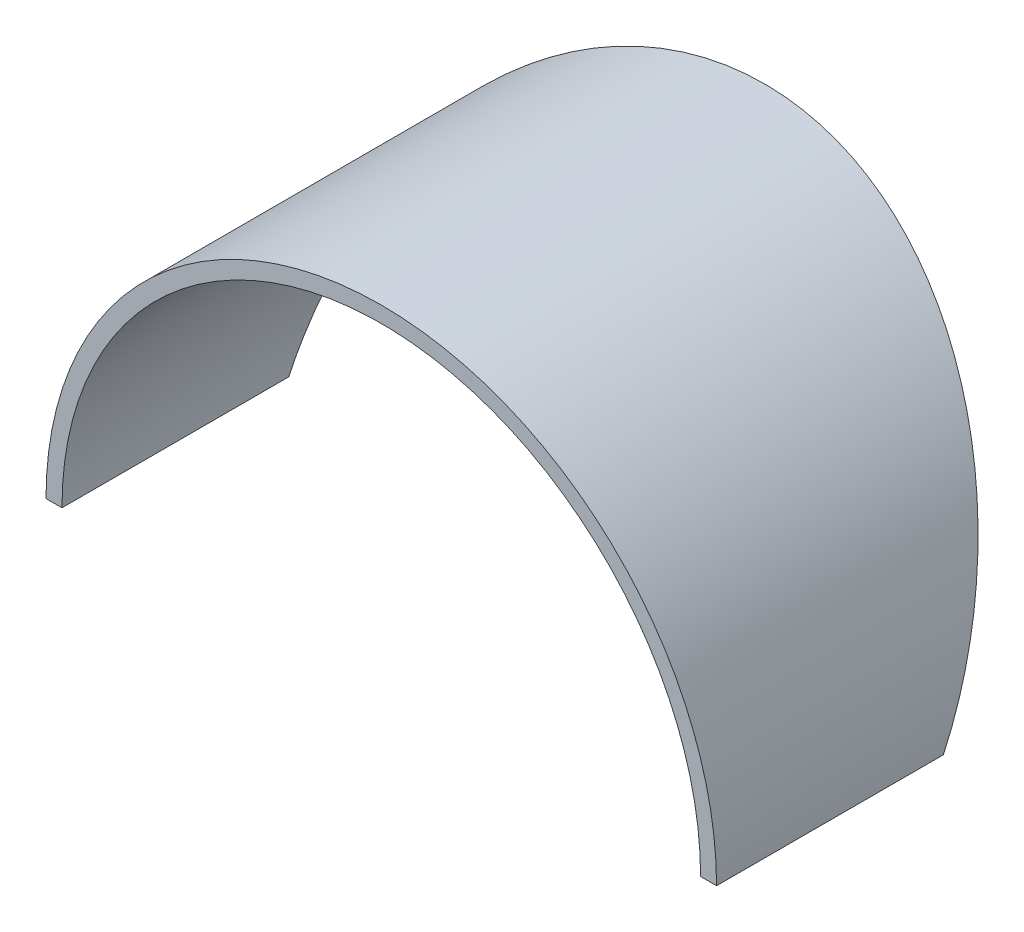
ISO-10303-21;
HEADER;
FILE_DESCRIPTION(('STEP AP214'),'2;1');
FILE_NAME('part.step','',(''),(''),'','','');
FILE_SCHEMA(('AUTOMOTIVE_DESIGN { 1 0 10303 214 1 1 1 1 }'));
ENDSEC;
DATA;
#1=APPLICATION_CONTEXT('core data for automotive mechanical design processes');
#2=APPLICATION_PROTOCOL_DEFINITION('international standard','automotive_design',2000,#1);
#3=PRODUCT_CONTEXT('',#1,'mechanical');
#4=PRODUCT('Part','Part','',(#3));
#5=PRODUCT_RELATED_PRODUCT_CATEGORY('part','',(#4));
#6=PRODUCT_DEFINITION_FORMATION('','',#4);
#7=PRODUCT_DEFINITION_CONTEXT('part definition',#1,'design');
#8=PRODUCT_DEFINITION('design','',#6,#7);
#9=PRODUCT_DEFINITION_SHAPE('','',#8);
#10=(LENGTH_UNIT() NAMED_UNIT(*) SI_UNIT(.MILLI.,.METRE.));
#11=(NAMED_UNIT(*) PLANE_ANGLE_UNIT() SI_UNIT($,.RADIAN.));
#12=(NAMED_UNIT(*) SI_UNIT($,.STERADIAN.) SOLID_ANGLE_UNIT());
#13=UNCERTAINTY_MEASURE_WITH_UNIT(LENGTH_MEASURE(1.E-05),#10,'distance_accuracy_value','');
#14=(GEOMETRIC_REPRESENTATION_CONTEXT(3) GLOBAL_UNCERTAINTY_ASSIGNED_CONTEXT((#13)) GLOBAL_UNIT_ASSIGNED_CONTEXT((#10,
#11,#12)) REPRESENTATION_CONTEXT('',''));
#15=CARTESIAN_POINT('',(0.,0.,0.));
#16=DIRECTION('',(0.,0.,1.));
#17=DIRECTION('',(1.,0.,0.));
#18=AXIS2_PLACEMENT_3D('',#15,#16,#17);
#19=CARTESIAN_POINT('',(-118.872,109.22,76.2));
#20=DIRECTION('',(0.,0.,-1.));
#21=DIRECTION('',(-1.,0.,0.));
#22=AXIS2_PLACEMENT_3D('',#19,#20,#21);
#23=CYLINDRICAL_SURFACE('',#22,63.5);
#24=DIRECTION('',(0.,0.,-1.));
#25=VECTOR('',#24,1.);
#26=CARTESIAN_POINT('',(-182.372,109.22,76.2));
#27=LINE('',#26,#25);
#28=CARTESIAN_POINT('',(-182.372,109.22,76.2));
#29=VERTEX_POINT('',#28);
#30=CARTESIAN_POINT('',(-182.372,109.22,31.091063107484));
#31=VERTEX_POINT('',#30);
#32=EDGE_CURVE('E92',#29,#31,#27,.T.);
#33=ORIENTED_EDGE('',*,*,#32,.T.);
#34=CARTESIAN_POINT('',(-118.872,109.22,31.091063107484));
#35=DIRECTION('',(0.,0.422618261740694,0.906307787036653));
#36=DIRECTION('',(0.,0.906307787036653,-0.422618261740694));
#37=AXIS2_PLACEMENT_3D('',#34,#35,#36);
#38=ELLIPSE('',#37,70.064497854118,63.5);
#39=CARTESIAN_POINT('',(-55.372,109.22,31.091063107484));
#40=VERTEX_POINT('',#39);
#41=EDGE_CURVE('E49',#31,#40,#38,.F.);
#42=ORIENTED_EDGE('',*,*,#41,.T.);
#43=DIRECTION('',(0.,0.,-1.));
#44=VECTOR('',#43,1.);
#45=CARTESIAN_POINT('',(-55.372,109.22,76.2));
#46=LINE('',#45,#44);
#47=CARTESIAN_POINT('',(-55.372,109.22,76.2));
#48=VERTEX_POINT('',#47);
#49=EDGE_CURVE('E11',#48,#40,#46,.T.);
#50=ORIENTED_EDGE('',*,*,#49,.F.);
#51=CARTESIAN_POINT('',(-118.872,109.22,76.2));
#52=DIRECTION('',(0.,0.,-1.));
#53=DIRECTION('',(1.,0.,0.));
#54=AXIS2_PLACEMENT_3D('',#51,#52,#53);
#55=CIRCLE('',#54,63.5);
#56=EDGE_CURVE('E101',#29,#48,#55,.T.);
#57=ORIENTED_EDGE('',*,*,#56,.F.);
#58=EDGE_LOOP('',(#33,#42,#50,#57));
#59=FACE_BOUND('',#58,.T.);
#60=ADVANCED_FACE('F35',(#59),#23,.F.);
#61=CARTESIAN_POINT('',(-55.372,109.22,76.2));
#62=DIRECTION('',(0.,1.,0.));
#63=DIRECTION('',(0.,0.,1.));
#64=AXIS2_PLACEMENT_3D('',#61,#62,#63);
#65=PLANE('',#64);
#66=ORIENTED_EDGE('',*,*,#49,.T.);
#67=DIRECTION('',(1.,0.,0.));
#68=VECTOR('',#67,1.);
#69=CARTESIAN_POINT('',(-185.547,109.22,31.091063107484));
#70=LINE('',#69,#68);
#71=CARTESIAN_POINT('',(-52.197,109.22,31.091063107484));
#72=VERTEX_POINT('',#71);
#73=EDGE_CURVE('E89',#40,#72,#70,.T.);
#74=ORIENTED_EDGE('',*,*,#73,.T.);
#75=DIRECTION('',(0.,0.,-1.));
#76=VECTOR('',#75,1.);
#77=CARTESIAN_POINT('',(-52.197,109.22,76.2));
#78=LINE('',#77,#76);
#79=CARTESIAN_POINT('',(-52.197,109.22,76.2));
#80=VERTEX_POINT('',#79);
#81=EDGE_CURVE('E42',#80,#72,#78,.T.);
#82=ORIENTED_EDGE('',*,*,#81,.F.);
#83=DIRECTION('',(1.,0.,0.));
#84=VECTOR('',#83,1.);
#85=CARTESIAN_POINT('',(-55.372,109.22,76.2));
#86=LINE('',#85,#84);
#87=EDGE_CURVE('E99',#48,#80,#86,.T.);
#88=ORIENTED_EDGE('',*,*,#87,.F.);
#89=EDGE_LOOP('',(#66,#74,#82,#88));
#90=FACE_BOUND('',#89,.T.);
#91=ADVANCED_FACE('F107',(#90),#65,.F.);
#92=CARTESIAN_POINT('',(-118.872,109.22,76.2));
#93=DIRECTION('',(0.,0.,-1.));
#94=DIRECTION('',(-1.,0.,0.));
#95=AXIS2_PLACEMENT_3D('',#92,#93,#94);
#96=CYLINDRICAL_SURFACE('',#95,66.675);
#97=CARTESIAN_POINT('',(-118.872,109.22,31.091063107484));
#98=DIRECTION('',(0.,0.422618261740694,0.906307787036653));
#99=DIRECTION('',(0.,0.906307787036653,-0.422618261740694));
#100=AXIS2_PLACEMENT_3D('',#97,#98,#99);
#101=ELLIPSE('',#100,73.5677227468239,66.675);
#102=CARTESIAN_POINT('',(-185.547,109.22,31.091063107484));
#103=VERTEX_POINT('',#102);
#104=EDGE_CURVE('E77',#72,#103,#101,.T.);
#105=ORIENTED_EDGE('',*,*,#104,.T.);
#106=DIRECTION('',(0.,0.,-1.));
#107=VECTOR('',#106,1.);
#108=CARTESIAN_POINT('',(-185.547,109.22,76.2));
#109=LINE('',#108,#107);
#110=CARTESIAN_POINT('',(-185.547,109.22,76.2));
#111=VERTEX_POINT('',#110);
#112=EDGE_CURVE('E81',#111,#103,#109,.T.);
#113=ORIENTED_EDGE('',*,*,#112,.F.);
#114=CARTESIAN_POINT('',(-118.872,109.22,76.2));
#115=DIRECTION('',(0.,0.,1.));
#116=DIRECTION('',(1.,0.,0.));
#117=AXIS2_PLACEMENT_3D('',#114,#115,#116);
#118=CIRCLE('',#117,66.675);
#119=EDGE_CURVE('E97',#80,#111,#118,.T.);
#120=ORIENTED_EDGE('',*,*,#119,.F.);
#121=ORIENTED_EDGE('',*,*,#81,.T.);
#122=EDGE_LOOP('',(#105,#113,#120,#121));
#123=FACE_BOUND('',#122,.T.);
#124=ADVANCED_FACE('F78',(#123),#96,.T.);
#125=CARTESIAN_POINT('',(-182.372,109.22,76.2));
#126=DIRECTION('',(0.,1.,0.));
#127=DIRECTION('',(-1.,0.,0.));
#128=AXIS2_PLACEMENT_3D('',#125,#126,#127);
#129=PLANE('',#128);
#130=ORIENTED_EDGE('',*,*,#112,.T.);
#131=EDGE_CURVE('E84',#103,#31,#70,.T.);
#132=ORIENTED_EDGE('',*,*,#131,.T.);
#133=ORIENTED_EDGE('',*,*,#32,.F.);
#134=DIRECTION('',(1.,0.,0.));
#135=VECTOR('',#134,1.);
#136=CARTESIAN_POINT('',(-182.372,109.22,76.2));
#137=LINE('',#136,#135);
#138=EDGE_CURVE('E57',#111,#29,#137,.T.);
#139=ORIENTED_EDGE('',*,*,#138,.F.);
#140=EDGE_LOOP('',(#130,#132,#133,#139));
#141=FACE_BOUND('',#140,.T.);
#142=ADVANCED_FACE('F91',(#141),#129,.F.);
#143=CARTESIAN_POINT('',(-118.872,109.22,76.2));
#144=DIRECTION('',(0.,0.,1.));
#145=DIRECTION('',(1.,0.,0.));
#146=AXIS2_PLACEMENT_3D('',#143,#144,#145);
#147=PLANE('',#146);
#148=ORIENTED_EDGE('',*,*,#56,.T.);
#149=ORIENTED_EDGE('',*,*,#87,.T.);
#150=ORIENTED_EDGE('',*,*,#119,.T.);
#151=ORIENTED_EDGE('',*,*,#138,.T.);
#152=EDGE_LOOP('',(#148,#149,#150,#151));
#153=FACE_BOUND('',#152,.T.);
#154=ADVANCED_FACE('F108',(#153),#147,.T.);
#155=CARTESIAN_POINT('',(-185.547,109.22,31.091063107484));
#156=DIRECTION('',(0.,0.422618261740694,0.906307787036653));
#157=DIRECTION('',(0.,-0.906307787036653,0.422618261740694));
#158=AXIS2_PLACEMENT_3D('',#155,#156,#157);
#159=PLANE('',#158);
#160=ORIENTED_EDGE('',*,*,#131,.F.);
#161=ORIENTED_EDGE('',*,*,#104,.F.);
#162=ORIENTED_EDGE('',*,*,#73,.F.);
#163=ORIENTED_EDGE('',*,*,#41,.F.);
#164=EDGE_LOOP('',(#160,#161,#162,#163));
#165=FACE_BOUND('',#164,.T.);
#166=ADVANCED_FACE('F86',(#165),#159,.F.);
#167=CLOSED_SHELL('',(#60,#91,#124,#142,#154,#166));
#168=MANIFOLD_SOLID_BREP('B2',#167);
#169=ADVANCED_BREP_SHAPE_REPRESENTATION('',(#18,#168),#14);
#170=SHAPE_DEFINITION_REPRESENTATION(#9,#169);
ENDSEC;
END-ISO-10303-21;
